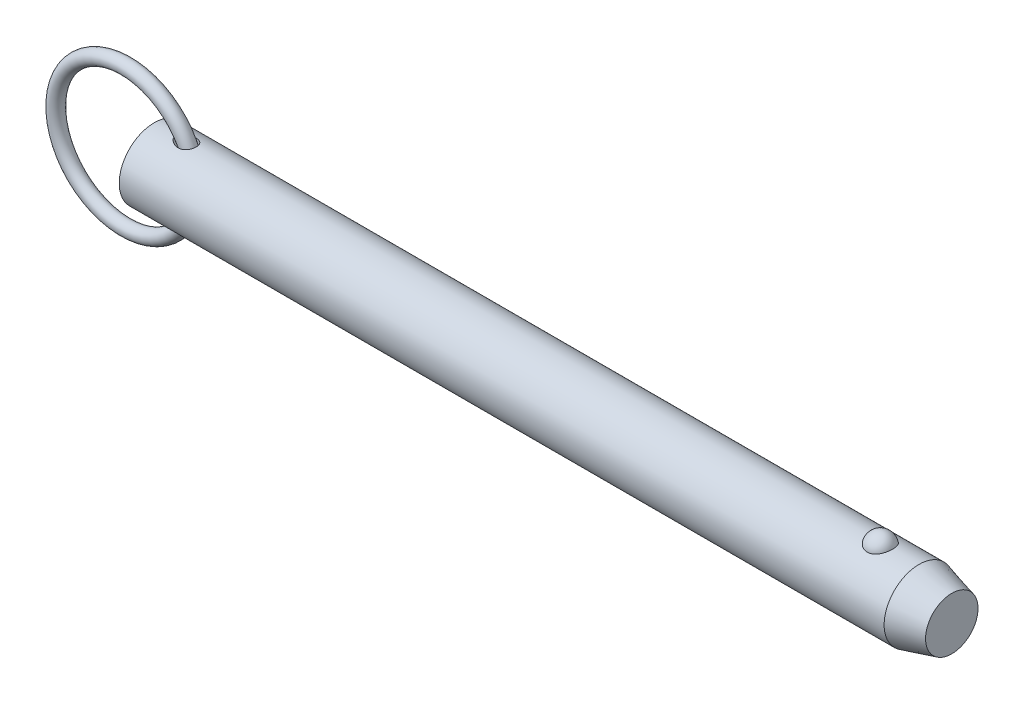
ISO-10303-21;
HEADER;
FILE_DESCRIPTION(('STEP AP214'),'2;1');
FILE_NAME('part.step','',(''),(''),'','','');
FILE_SCHEMA(('AUTOMOTIVE_DESIGN { 1 0 10303 214 1 1 1 1 }'));
ENDSEC;
DATA;
#1=APPLICATION_CONTEXT('core data for automotive mechanical design processes');
#2=APPLICATION_PROTOCOL_DEFINITION('international standard','automotive_design',2000,#1);
#3=PRODUCT_CONTEXT('',#1,'mechanical');
#4=PRODUCT('Part','Part','',(#3));
#5=PRODUCT_RELATED_PRODUCT_CATEGORY('part','',(#4));
#6=PRODUCT_DEFINITION_FORMATION('','',#4);
#7=PRODUCT_DEFINITION_CONTEXT('part definition',#1,'design');
#8=PRODUCT_DEFINITION('design','',#6,#7);
#9=PRODUCT_DEFINITION_SHAPE('','',#8);
#10=(LENGTH_UNIT() NAMED_UNIT(*) SI_UNIT(.MILLI.,.METRE.));
#11=(NAMED_UNIT(*) PLANE_ANGLE_UNIT() SI_UNIT($,.RADIAN.));
#12=(NAMED_UNIT(*) SI_UNIT($,.STERADIAN.) SOLID_ANGLE_UNIT());
#13=UNCERTAINTY_MEASURE_WITH_UNIT(LENGTH_MEASURE(1.E-05),#10,'distance_accuracy_value','');
#14=(GEOMETRIC_REPRESENTATION_CONTEXT(3) GLOBAL_UNCERTAINTY_ASSIGNED_CONTEXT((#13)) GLOBAL_UNIT_ASSIGNED_CONTEXT((#10,
#11,#12)) REPRESENTATION_CONTEXT('',''));
#15=CARTESIAN_POINT('',(0.,0.,0.));
#16=DIRECTION('',(0.,0.,1.));
#17=DIRECTION('',(1.,0.,0.));
#18=AXIS2_PLACEMENT_3D('',#15,#16,#17);
#19=CARTESIAN_POINT('',(-6.46799987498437,0.,0.));
#20=DIRECTION('',(0.,0.,1.));
#21=DIRECTION('',(1.,0.,0.));
#22=AXIS2_PLACEMENT_3D('',#19,#20,#21);
#23=TOROIDAL_SURFACE('',#22,15.875,1.588);
#24=CARTESIAN_POINT('',(10.9950001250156,0.,0.));
#25=VERTEX_POINT('',#24);
#26=VERTEX_LOOP('',#25);
#27=FACE_BOUND('',#26,.T.);
#28=ADVANCED_FACE('P0_F12',(#27),#23,.T.);
#29=CLOSED_SHELL('',(#28));
#30=MANIFOLD_SOLID_BREP('P0_B1',#29);
#31=CARTESIAN_POINT('',(0.,0.,0.));
#32=DIRECTION('',(1.,0.,0.));
#33=DIRECTION('',(0.,0.,-1.));
#34=AXIS2_PLACEMENT_3D('',#31,#32,#33);
#35=CYLINDRICAL_SURFACE('',#34,7.94);
#36=CARTESIAN_POINT('',(4.99454278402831,7.92831028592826,-0.430692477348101));
#37=CARTESIAN_POINT('',(5.02621962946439,7.92271974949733,-0.533554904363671));
#38=CARTESIAN_POINT('',(5.06869972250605,7.91528872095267,-0.633052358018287));
#39=CARTESIAN_POINT('',(5.17094751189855,7.89785690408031,-0.822566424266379));
#40=CARTESIAN_POINT('',(5.23077290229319,7.88784755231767,-0.912550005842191));
#41=CARTESIAN_POINT('',(5.37866013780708,7.8639674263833,-1.10117829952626));
#42=CARTESIAN_POINT('',(5.47004908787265,7.84973599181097,-1.19714712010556));
#43=CARTESIAN_POINT('',(5.66695490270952,7.82090787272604,-1.37293476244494));
#44=CARTESIAN_POINT('',(5.77247743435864,7.80631104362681,-1.45274707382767));
#45=CARTESIAN_POINT('',(5.99604254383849,7.77793596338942,-1.59776875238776));
#46=CARTESIAN_POINT('',(6.11428384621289,7.76417836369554,-1.66267404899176));
#47=CARTESIAN_POINT('',(6.35882685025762,7.73912410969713,-1.77564129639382));
#48=CARTESIAN_POINT('',(6.48513256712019,7.72782869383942,-1.82369477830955));
#49=CARTESIAN_POINT('',(6.76898453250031,7.70705630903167,-1.90977520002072));
#50=CARTESIAN_POINT('',(6.92778004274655,7.69837706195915,-1.94395681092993));
#51=CARTESIAN_POINT('',(7.24915504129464,7.6881294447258,-1.98412381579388));
#52=CARTESIAN_POINT('',(7.41173039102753,7.68655363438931,-1.99013871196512));
#53=CARTESIAN_POINT('',(7.697714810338,7.69094561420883,-1.97306069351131));
#54=CARTESIAN_POINT('',(7.82153338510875,7.69526202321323,-1.95634328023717));
#55=CARTESIAN_POINT('',(8.06460511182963,7.70859273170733,-1.90314615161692));
#56=CARTESIAN_POINT('',(8.18386164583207,7.7176034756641,-1.86668139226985));
#57=CARTESIAN_POINT('',(8.41450663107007,7.73959050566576,-1.77331230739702));
#58=CARTESIAN_POINT('',(8.52585042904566,7.75258738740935,-1.71630154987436));
#59=CARTESIAN_POINT('',(8.73575290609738,7.7809705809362,-1.58263416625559));
#60=CARTESIAN_POINT('',(8.83431445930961,7.7963563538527,-1.50598196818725));
#61=CARTESIAN_POINT('',(9.00639839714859,7.8259635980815,-1.34315626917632));
#62=CARTESIAN_POINT('',(9.08139772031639,7.84016008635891,-1.25853389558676));
#63=CARTESIAN_POINT('',(9.21545590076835,7.86710959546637,-1.07729126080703));
#64=CARTESIAN_POINT('',(9.27451869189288,7.87986297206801,-0.980673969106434));
#65=CARTESIAN_POINT('',(9.37315031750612,7.90198817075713,-0.782161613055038));
#66=CARTESIAN_POINT('',(9.41336512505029,7.91146854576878,-0.68059867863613));
#67=CARTESIAN_POINT('',(9.47650914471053,7.92664976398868,-0.471967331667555));
#68=CARTESIAN_POINT('',(9.49943917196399,7.93235078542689,-0.364899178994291));
#69=CARTESIAN_POINT('',(9.5274466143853,7.93934369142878,-0.14863226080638));
#70=CARTESIAN_POINT('',(9.53257574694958,7.9406483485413,-0.0394405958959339));
#71=CARTESIAN_POINT('',(9.52501411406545,7.93874464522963,0.178286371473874));
#72=CARTESIAN_POINT('',(9.51232314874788,7.93553623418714,0.286821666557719));
#73=CARTESIAN_POINT('',(9.46937875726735,7.92494527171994,0.500278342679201));
#74=CARTESIAN_POINT('',(9.43910562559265,7.9175580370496,0.605195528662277));
#75=CARTESIAN_POINT('',(9.36168926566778,7.8994090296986,0.808294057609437));
#76=CARTESIAN_POINT('',(9.3145467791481,7.88864740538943,0.906475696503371));
#77=CARTESIAN_POINT('',(9.20464679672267,7.86494645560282,1.09319438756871));
#78=CARTESIAN_POINT('',(9.14191093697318,7.85201015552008,1.18174456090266));
#79=CARTESIAN_POINT('',(9.00249124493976,7.82536913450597,1.34692675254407));
#80=CARTESIAN_POINT('',(8.92580850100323,7.81166447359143,1.42355969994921));
#81=CARTESIAN_POINT('',(8.76033130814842,7.78490157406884,1.56333296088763));
#82=CARTESIAN_POINT('',(8.67148512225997,7.77184644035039,1.62641250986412));
#83=CARTESIAN_POINT('',(8.48457694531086,7.74778101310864,1.73744892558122));
#84=CARTESIAN_POINT('',(8.38651410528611,7.73677090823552,1.78540439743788));
#85=CARTESIAN_POINT('',(8.18013312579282,7.71742695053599,1.86728938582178));
#86=CARTESIAN_POINT('',(8.07156725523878,7.7092102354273,1.90061897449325));
#87=CARTESIAN_POINT('',(7.85050876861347,7.6966502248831,1.95085652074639));
#88=CARTESIAN_POINT('',(7.73801453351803,7.69230854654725,1.967757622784));
#89=CARTESIAN_POINT('',(7.50002163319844,7.6873799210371,1.98693391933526));
#90=CARTESIAN_POINT('',(7.37438052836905,7.68722739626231,1.98751701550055));
#91=CARTESIAN_POINT('',(7.12435864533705,7.69142268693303,1.97121025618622));
#92=CARTESIAN_POINT('',(6.99997834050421,7.6957721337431,1.9543140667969));
#93=CARTESIAN_POINT('',(6.73521978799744,7.70925573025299,1.90049277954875));
#94=CARTESIAN_POINT('',(6.59543541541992,7.71903968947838,1.86081454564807));
#95=CARTESIAN_POINT('',(6.32319848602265,7.74233460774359,1.76138158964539));
#96=CARTESIAN_POINT('',(6.19076082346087,7.75585282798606,1.7015877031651));
#97=CARTESIAN_POINT('',(5.99269110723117,7.7785835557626,1.59336057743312));
#98=CARTESIAN_POINT('',(5.92332049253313,7.78707101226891,1.55151799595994));
#99=CARTESIAN_POINT('',(5.78862576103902,7.80440479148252,1.46183267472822));
#100=CARTESIAN_POINT('',(5.72330291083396,7.81325122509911,1.41398807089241));
#101=CARTESIAN_POINT('',(5.53492618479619,7.83980388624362,1.26162857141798));
#102=CARTESIAN_POINT('',(5.41884115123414,7.85759887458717,1.14795556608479));
#103=CARTESIAN_POINT('',(5.25731156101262,7.88350844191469,0.948390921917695));
#104=CARTESIAN_POINT('',(5.20241173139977,7.89260196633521,0.87019982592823));
#105=CARTESIAN_POINT('',(5.10541071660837,7.90897737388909,0.70602680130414));
#106=CARTESIAN_POINT('',(5.06329682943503,7.91626105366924,0.620052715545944));
#107=CARTESIAN_POINT('',(4.99458837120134,7.92827352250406,0.440665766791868));
#108=CARTESIAN_POINT('',(4.96816655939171,7.93297382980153,0.347182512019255));
#109=CARTESIAN_POINT('',(4.94275291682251,7.93751024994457,0.204498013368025));
#110=CARTESIAN_POINT('',(4.93665149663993,7.9386033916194,0.156529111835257));
#111=CARTESIAN_POINT('',(4.92932198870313,7.93991739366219,0.0602142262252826));
#112=CARTESIAN_POINT('',(4.92809242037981,7.94013851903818,0.011868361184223));
#113=CARTESIAN_POINT('',(4.93104052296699,7.93960920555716,-0.103241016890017));
#114=CARTESIAN_POINT('',(4.93747289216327,7.93845361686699,-0.169956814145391));
#115=CARTESIAN_POINT('',(4.95939910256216,7.93453812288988,-0.301777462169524));
#116=CARTESIAN_POINT('',(4.97489225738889,7.9317783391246,-0.36688243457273));
#117=CARTESIAN_POINT('',(4.99454278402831,7.92831028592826,-0.430692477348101));
#118=B_SPLINE_CURVE_WITH_KNOTS('',3,(#36,#37,#38,#39,#40,#41,#42,#43,#44,#45,#46,#47,#48,#49,
#50,#51,#52,#53,#54,#55,#56,#57,#58,#59,#60,#61,#62,#63,#64,#65,#66,#67,#68,#69,#70,#71,#72,#73,
#74,#75,#76,#77,#78,#79,#80,#81,#82,#83,#84,#85,#86,#87,#88,#89,#90,#91,#92,#93,#94,#95,#96,#97,
#98,#99,#100,#101,#102,#103,#104,#105,#106,#107,#108,#109,#110,#111,#112,#113,#114,#115,#116,
#117),.UNSPECIFIED.,.T.,.F.,(4,2,2,2,2,2,2,2,2,2,2,2,2,2,2,2,2,2,2,2,2,2,2,2,2,2,2,2,2,2,2,2,2,
2,2,2,2,2,2,2,4),(0.,0.323000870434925,0.647088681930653,1.04479679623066,1.4426648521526,
1.84804279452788,2.25362416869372,2.73917777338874,3.2242226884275,3.59772765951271,
3.97095014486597,4.34613445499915,4.72123425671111,5.06140749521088,5.40149668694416,
5.72887751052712,6.05624289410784,6.38265637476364,6.70907351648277,7.03585720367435,
7.36262652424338,7.68894495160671,8.01523792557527,8.34296459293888,8.67072147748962,
9.01089033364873,9.35120108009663,9.72668268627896,10.1023004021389,10.5375309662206,
10.9736138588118,11.2176803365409,11.461822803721,11.9480055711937,12.2349837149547,
12.5216758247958,12.8114683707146,12.9563497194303,13.1011870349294,13.3015737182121,
13.5019452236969),.UNSPECIFIED.);
#119=CARTESIAN_POINT('',(4.99454278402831,7.92831028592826,-0.430692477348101));
#120=VERTEX_POINT('',#119);
#121=EDGE_CURVE('P1_E40',#120,#120,#118,.T.);
#122=ORIENTED_EDGE('',*,*,#121,.T.);
#123=EDGE_LOOP('',(#122));
#124=FACE_BOUND('',#123,.T.);
#125=CARTESIAN_POINT('',(173.571879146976,0.,0.));
#126=DIRECTION('',(1.,0.,0.));
#127=DIRECTION('',(0.,0.,-1.));
#128=AXIS2_PLACEMENT_3D('',#125,#126,#127);
#129=CIRCLE('',#128,7.94);
#130=CARTESIAN_POINT('',(173.571879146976,0.,-7.94));
#131=VERTEX_POINT('',#130);
#132=EDGE_CURVE('P1_E25',#131,#131,#129,.T.);
#133=ORIENTED_EDGE('',*,*,#132,.F.);
#134=EDGE_LOOP('',(#133));
#135=FACE_BOUND('',#134,.T.);
#136=CARTESIAN_POINT('',(0.,0.,0.));
#137=DIRECTION('',(1.,0.,0.));
#138=DIRECTION('',(0.,0.,-1.));
#139=AXIS2_PLACEMENT_3D('',#136,#137,#138);
#140=CIRCLE('',#139,7.94);
#141=CARTESIAN_POINT('',(0.,0.,-7.94));
#142=VERTEX_POINT('',#141);
#143=EDGE_CURVE('P1_E9',#142,#142,#140,.T.);
#144=ORIENTED_EDGE('',*,*,#143,.T.);
#145=EDGE_LOOP('',(#144));
#146=FACE_BOUND('',#145,.T.);
#147=CARTESIAN_POINT('',(164.764907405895,7.37767842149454,2.93486986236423));
#148=CARTESIAN_POINT('',(164.612749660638,7.3776732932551,2.93487505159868));
#149=CARTESIAN_POINT('',(164.460632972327,7.38258419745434,2.92262454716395));
#150=CARTESIAN_POINT('',(164.160928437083,7.40163229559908,2.87404196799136));
#151=CARTESIAN_POINT('',(164.013339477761,7.41576720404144,2.83771585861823));
#152=CARTESIAN_POINT('',(163.727018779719,7.4516157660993,2.74218769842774));
#153=CARTESIAN_POINT('',(163.588274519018,7.47331841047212,2.68301886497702));
#154=CARTESIAN_POINT('',(163.322882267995,7.52194082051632,2.54350967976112));
#155=CARTESIAN_POINT('',(163.196236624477,7.54886159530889,2.46316523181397));
#156=CARTESIAN_POINT('',(162.954534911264,7.60594671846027,2.28090375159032));
#157=CARTESIAN_POINT('',(162.839906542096,7.63618114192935,2.1784421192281));
#158=CARTESIAN_POINT('',(162.628878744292,7.69614046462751,1.95608495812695));
#159=CARTESIAN_POINT('',(162.532482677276,7.72586526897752,1.83618622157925));
#160=CARTESIAN_POINT('',(162.355938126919,7.78314821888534,1.57628086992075));
#161=CARTESIAN_POINT('',(162.276707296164,7.81055035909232,1.43561546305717));
#162=CARTESIAN_POINT('',(162.141797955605,7.85879631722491,1.142363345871));
#163=CARTESIAN_POINT('',(162.086121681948,7.87963951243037,0.989775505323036));
#164=CARTESIAN_POINT('',(161.99881215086,7.91289645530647,0.674619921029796));
#165=CARTESIAN_POINT('',(161.96753090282,7.92518652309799,0.511941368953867));
#166=CARTESIAN_POINT('',(161.930975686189,7.93958930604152,0.183247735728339));
#167=CARTESIAN_POINT('',(161.925701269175,7.94170219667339,0.0172327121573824));
#168=CARTESIAN_POINT('',(161.941231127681,7.93554931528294,-0.312672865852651));
#169=CARTESIAN_POINT('',(161.961925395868,7.92732732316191,-0.476569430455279));
#170=CARTESIAN_POINT('',(162.02878655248,7.90141534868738,-0.798305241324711));
#171=CARTESIAN_POINT('',(162.074953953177,7.88372517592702,-0.956144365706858));
#172=CARTESIAN_POINT('',(162.191898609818,7.84066230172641,-1.26152073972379));
#173=CARTESIAN_POINT('',(162.262704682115,7.81528060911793,-1.40904568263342));
#174=CARTESIAN_POINT('',(162.427478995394,7.75948672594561,-1.68950598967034));
#175=CARTESIAN_POINT('',(162.521448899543,7.72907417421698,-1.82244030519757));
#176=CARTESIAN_POINT('',(162.730839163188,7.66640424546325,-2.07032792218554));
#177=CARTESIAN_POINT('',(162.846315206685,7.63414223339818,-2.18523308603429));
#178=CARTESIAN_POINT('',(163.0959006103,7.57149681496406,-2.39329737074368));
#179=CARTESIAN_POINT('',(163.230008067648,7.54111321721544,-2.48645870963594));
#180=CARTESIAN_POINT('',(163.510111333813,7.48650742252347,-2.64628132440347));
#181=CARTESIAN_POINT('',(163.655760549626,7.46215900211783,-2.71350554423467));
#182=CARTESIAN_POINT('',(163.957425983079,7.42171253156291,-2.82226614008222));
#183=CARTESIAN_POINT('',(164.113438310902,7.40561140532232,-2.86381209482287));
#184=CARTESIAN_POINT('',(164.422970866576,7.3842679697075,-2.9183907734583));
#185=CARTESIAN_POINT('',(164.576222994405,7.37852109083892,-2.93275024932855));
#186=CARTESIAN_POINT('',(164.883070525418,7.37700973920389,-2.93655208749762));
#187=CARTESIAN_POINT('',(165.036665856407,7.38124333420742,-2.92599927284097));
#188=CARTESIAN_POINT('',(165.334990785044,7.39890635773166,-2.88102897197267));
#189=CARTESIAN_POINT('',(165.479848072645,7.41205491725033,-2.84733999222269));
#190=CARTESIAN_POINT('',(165.76164329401,7.445801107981,-2.75788206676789));
#191=CARTESIAN_POINT('',(165.898580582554,7.46639934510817,-2.70211132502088));
#192=CARTESIAN_POINT('',(166.164061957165,7.51339098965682,-2.56858908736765));
#193=CARTESIAN_POINT('',(166.292354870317,7.53990200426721,-2.4903806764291));
#194=CARTESIAN_POINT('',(166.534244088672,7.59569503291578,-2.31462737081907));
#195=CARTESIAN_POINT('',(166.647837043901,7.6249776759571,-2.21707808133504));
#196=CARTESIAN_POINT('',(166.86322156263,7.68489473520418,-1.99982049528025));
#197=CARTESIAN_POINT('',(166.964148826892,7.71552419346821,-1.87925337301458));
#198=CARTESIAN_POINT('',(167.145186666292,7.77353016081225,-1.6226882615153));
#199=CARTESIAN_POINT('',(167.225293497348,7.80090608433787,-1.48668750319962));
#200=CARTESIAN_POINT('',(167.365361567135,7.85047992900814,-1.1981841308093));
#201=CARTESIAN_POINT('',(167.424587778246,7.87248183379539,-1.04529016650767));
#202=CARTESIAN_POINT('',(167.517982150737,7.90785114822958,-0.731080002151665));
#203=CARTESIAN_POINT('',(167.552149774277,7.92121837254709,-0.569763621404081));
#204=CARTESIAN_POINT('',(167.594795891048,7.93797834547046,-0.242812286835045));
#205=CARTESIAN_POINT('',(167.603204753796,7.94134405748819,-0.0771668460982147));
#206=CARTESIAN_POINT('',(167.593962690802,7.93767937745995,0.253276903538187));
#207=CARTESIAN_POINT('',(167.576312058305,7.93064910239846,0.418075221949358));
#208=CARTESIAN_POINT('',(167.515424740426,7.90695571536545,0.741525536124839));
#209=CARTESIAN_POINT('',(167.472281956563,7.8903279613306,0.900197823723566));
#210=CARTESIAN_POINT('',(167.36135358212,7.84916386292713,1.20759654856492));
#211=CARTESIAN_POINT('',(167.29356656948,7.82462706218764,1.35632241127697));
#212=CARTESIAN_POINT('',(167.134371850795,7.77006699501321,1.64032869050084));
#213=CARTESIAN_POINT('',(167.042861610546,7.74002008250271,1.7755471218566));
#214=CARTESIAN_POINT('',(166.838296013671,7.67774175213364,2.0280064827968));
#215=CARTESIAN_POINT('',(166.725241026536,7.64551037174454,2.14524772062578));
#216=CARTESIAN_POINT('',(166.480831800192,7.58265895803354,2.35778002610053));
#217=CARTESIAN_POINT('',(166.349583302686,7.5520309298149,2.45319004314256));
#218=CARTESIAN_POINT('',(166.071601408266,7.49579792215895,2.61999897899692));
#219=CARTESIAN_POINT('',(165.924867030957,7.47019326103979,2.69139637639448));
#220=CARTESIAN_POINT('',(165.612947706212,7.42622216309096,2.8105324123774));
#221=CARTESIAN_POINT('',(165.447220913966,7.40825002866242,2.85700910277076));
#222=CARTESIAN_POINT('',(165.109279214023,7.38398348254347,2.9191685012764));
#223=CARTESIAN_POINT('',(164.93706702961,7.3776842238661,2.93486399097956));
#224=CARTESIAN_POINT('',(164.764907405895,7.37767842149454,2.93486986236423));
#225=B_SPLINE_CURVE_WITH_KNOTS('',3,(#147,#148,#149,#150,#151,#152,#153,#154,#155,#156,#157,
#158,#159,#160,#161,#162,#163,#164,#165,#166,#167,#168,#169,#170,#171,#172,#173,#174,#175,#176,
#177,#178,#179,#180,#181,#182,#183,#184,#185,#186,#187,#188,#189,#190,#191,#192,#193,#194,#195,
#196,#197,#198,#199,#200,#201,#202,#203,#204,#205,#206,#207,#208,#209,#210,#211,#212,#213,#214,
#215,#216,#217,#218,#219,#220,#221,#222,#223,#224),.UNSPECIFIED.,.T.,.F.,(4,2,2,2,2,2,2,2,2,2,2,
2,2,2,2,2,2,2,2,2,2,2,2,2,2,2,2,2,2,2,2,2,2,2,2,2,2,2,4),(0.,0.455841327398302,
0.911569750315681,1.36663794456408,1.82179423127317,2.2897898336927,2.75787163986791,
3.24685368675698,3.73588214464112,4.23184282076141,4.72779494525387,5.22165321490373,
5.71552141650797,6.20996917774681,6.7044524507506,7.20023431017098,7.69596557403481,
8.18023418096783,8.66432203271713,9.12410697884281,9.58380291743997,10.0296503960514,
10.4755341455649,10.9312349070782,11.3870393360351,11.8654416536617,12.3439299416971,
12.8378875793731,13.3318558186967,13.8271581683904,14.3224549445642,14.8159385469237,
15.3094506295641,15.8051323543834,16.3008055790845,16.7937101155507,17.2866458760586,
17.8026240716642,18.3183879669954),.UNSPECIFIED.);
#226=CARTESIAN_POINT('',(164.764907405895,7.37767842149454,2.93486986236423));
#227=VERTEX_POINT('',#226);
#228=EDGE_CURVE('P1_E34',#227,#227,#225,.T.);
#229=ORIENTED_EDGE('',*,*,#228,.T.);
#230=EDGE_LOOP('',(#229));
#231=FACE_BOUND('',#230,.T.);
#232=CARTESIAN_POINT('',(4.99454278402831,-7.92831028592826,-0.430692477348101));
#233=CARTESIAN_POINT('',(4.97033227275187,-7.93258231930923,-0.352006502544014));
#234=CARTESIAN_POINT('',(4.95238785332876,-7.93578782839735,-0.271213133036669));
#235=CARTESIAN_POINT('',(4.93055628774,-7.93969351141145,-0.107590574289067));
#236=CARTESIAN_POINT('',(4.92668686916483,-7.9403905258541,-0.0247589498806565));
#237=CARTESIAN_POINT('',(4.9333808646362,-7.93918950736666,0.140249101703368));
#238=CARTESIAN_POINT('',(4.94393526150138,-7.93729309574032,0.222425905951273));
#239=CARTESIAN_POINT('',(4.97854187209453,-7.93113325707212,0.383746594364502));
#240=CARTESIAN_POINT('',(5.00259804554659,-7.92686913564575,0.462889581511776));
#241=CARTESIAN_POINT('',(5.06904511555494,-7.91526143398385,0.633278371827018));
#242=CARTESIAN_POINT('',(5.11430124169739,-7.90744739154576,0.723368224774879));
#243=CARTESIAN_POINT('',(5.21873327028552,-7.88988375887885,0.894880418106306));
#244=CARTESIAN_POINT('',(5.27793532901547,-7.88013053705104,0.976286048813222));
#245=CARTESIAN_POINT('',(5.42949971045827,-7.85602233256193,1.15646341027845));
#246=CARTESIAN_POINT('',(5.52624420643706,-7.84124381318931,1.25147911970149));
#247=CARTESIAN_POINT('',(5.73364751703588,-7.81163164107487,1.42469165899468));
#248=CARTESIAN_POINT('',(5.84432059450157,-7.79679794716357,1.50287102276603));
#249=CARTESIAN_POINT('',(6.07871104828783,-7.76824211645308,1.64418004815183));
#250=CARTESIAN_POINT('',(6.20267992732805,-7.75455572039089,1.70689813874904));
#251=CARTESIAN_POINT('',(6.45850163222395,-7.73013259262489,1.81429879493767));
#252=CARTESIAN_POINT('',(6.59035778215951,-7.71939711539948,1.85897369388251));
#253=CARTESIAN_POINT('',(6.88209177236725,-7.70072462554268,1.93500734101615));
#254=CARTESIAN_POINT('',(7.04295460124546,-7.69356120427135,1.96286607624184));
#255=CARTESIAN_POINT('',(7.36724421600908,-7.68676336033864,1.98935053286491));
#256=CARTESIAN_POINT('',(7.53066723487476,-7.68711875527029,1.98801578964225));
#257=CARTESIAN_POINT('',(7.81370255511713,-7.69496475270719,1.95735673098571));
#258=CARTESIAN_POINT('',(7.93413357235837,-7.70066491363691,1.93505220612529));
#259=CARTESIAN_POINT('',(8.16950597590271,-7.71642704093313,1.87121573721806));
#260=CARTESIAN_POINT('',(8.28445128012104,-7.72648584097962,1.82969774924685));
#261=CARTESIAN_POINT('',(8.50557964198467,-7.75006886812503,1.72707806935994));
#262=CARTESIAN_POINT('',(8.61171927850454,-7.76360905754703,1.66588583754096));
#263=CARTESIAN_POINT('',(8.810712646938,-7.79249659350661,1.52503518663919));
#264=CARTESIAN_POINT('',(8.90356827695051,-7.80784368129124,1.44537941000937));
#265=CARTESIAN_POINT('',(9.06550151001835,-7.83702302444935,1.27723027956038));
#266=CARTESIAN_POINT('',(9.1359139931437,-7.85087516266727,1.19002179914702));
#267=CARTESIAN_POINT('',(9.26060432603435,-7.87675706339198,1.00451336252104));
#268=CARTESIAN_POINT('',(9.31488561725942,-7.88878721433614,0.906215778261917));
#269=CARTESIAN_POINT('',(9.40446618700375,-7.90930761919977,0.70456335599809));
#270=CARTESIAN_POINT('',(9.44028687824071,-7.91789338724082,0.601449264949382));
#271=CARTESIAN_POINT('',(9.49451523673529,-7.93109531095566,0.390496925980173));
#272=CARTESIAN_POINT('',(9.51292345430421,-7.93571159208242,0.282658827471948));
#273=CARTESIAN_POINT('',(9.53189686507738,-7.94047189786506,0.0654759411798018));
#274=CARTESIAN_POINT('',(9.53248611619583,-7.94062195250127,-0.0438666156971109));
#275=CARTESIAN_POINT('',(9.51587068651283,-7.93644929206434,-0.26110665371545));
#276=CARTESIAN_POINT('',(9.49866585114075,-7.93212653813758,-0.369004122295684));
#277=CARTESIAN_POINT('',(9.44682594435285,-7.91946859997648,-0.58038072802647));
#278=CARTESIAN_POINT('',(9.412176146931,-7.91113002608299,-0.683856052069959));
#279=CARTESIAN_POINT('',(9.32626198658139,-7.89134774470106,-0.883337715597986));
#280=CARTESIAN_POINT('',(9.27499851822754,-7.87990420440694,-0.979344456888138));
#281=CARTESIAN_POINT('',(9.15725058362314,-7.8551872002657,-1.1610523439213));
#282=CARTESIAN_POINT('',(9.09078836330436,-7.84191642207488,-1.24676827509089));
#283=CARTESIAN_POINT('',(8.94443523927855,-7.81498501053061,-1.40574704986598));
#284=CARTESIAN_POINT('',(8.86454527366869,-7.80132440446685,-1.47901076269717));
#285=CARTESIAN_POINT('',(8.69307774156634,-7.77497848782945,-1.61181253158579));
#286=CARTESIAN_POINT('',(8.60142539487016,-7.76230033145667,-1.67125525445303));
#287=CARTESIAN_POINT('',(8.40957687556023,-7.73928987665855,-1.77477159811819));
#288=CARTESIAN_POINT('',(8.30937953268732,-7.72895790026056,-1.81884310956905));
#289=CARTESIAN_POINT('',(8.0986350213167,-7.71113842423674,-1.89300673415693));
#290=CARTESIAN_POINT('',(7.98782526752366,-7.70379913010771,-1.92238394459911));
#291=CARTESIAN_POINT('',(7.76294389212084,-7.69313871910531,-1.96460780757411));
#292=CARTESIAN_POINT('',(7.64887102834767,-7.68981915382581,-1.9774480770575));
#293=CARTESIAN_POINT('',(7.40716929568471,-7.68706358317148,-1.98813881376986));
#294=CARTESIAN_POINT('',(7.27945620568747,-7.68810537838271,-1.98414471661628));
#295=CARTESIAN_POINT('',(7.02593945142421,-7.6946815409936,-1.95847707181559));
#296=CARTESIAN_POINT('',(6.90013720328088,-7.7002190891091,-1.93679100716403));
#297=CARTESIAN_POINT('',(6.63265145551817,-7.71617635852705,-1.87230070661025));
#298=CARTESIAN_POINT('',(6.49169161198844,-7.72724102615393,-1.82664736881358));
#299=CARTESIAN_POINT('',(6.21840602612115,-7.75282261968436,-1.71482542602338));
#300=CARTESIAN_POINT('',(6.08608498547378,-7.76734140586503,-1.64864576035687));
#301=CARTESIAN_POINT('',(5.84453114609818,-7.7967744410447,-1.50297952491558));
#302=CARTESIAN_POINT('',(5.73429128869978,-7.81154606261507,-1.4251373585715));
#303=CARTESIAN_POINT('',(5.52761180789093,-7.84104229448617,-1.25271210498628));
#304=CARTESIAN_POINT('',(5.43116004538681,-7.85576693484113,-1.15814390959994));
#305=CARTESIAN_POINT('',(5.27970568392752,-7.87984260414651,-0.978603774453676));
#306=CARTESIAN_POINT('',(5.22040249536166,-7.88960721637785,-0.897319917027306));
#307=CARTESIAN_POINT('',(5.11583115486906,-7.90718602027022,-0.726171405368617));
#308=CARTESIAN_POINT('',(5.07050564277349,-7.9150081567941,-0.636343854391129));
#309=CARTESIAN_POINT('',(5.01937588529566,-7.92393751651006,-0.506165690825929));
#310=CARTESIAN_POINT('',(5.00622932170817,-7.926248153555,-0.468674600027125));
#311=CARTESIAN_POINT('',(4.99454278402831,-7.92831028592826,-0.430692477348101));
#312=B_SPLINE_CURVE_WITH_KNOTS('',3,(#232,#233,#234,#235,#236,#237,#238,#239,#240,#241,#242,
#243,#244,#245,#246,#247,#248,#249,#250,#251,#252,#253,#254,#255,#256,#257,#258,#259,#260,#261,
#262,#263,#264,#265,#266,#267,#268,#269,#270,#271,#272,#273,#274,#275,#276,#277,#278,#279,#280,
#281,#282,#283,#284,#285,#286,#287,#288,#289,#290,#291,#292,#293,#294,#295,#296,#297,#298,#299,
#300,#301,#302,#303,#304,#305,#306,#307,#308,#309,#310,#311),.UNSPECIFIED.,.T.,.F.,(4,2,2,2,2,2,
2,2,2,2,2,2,2,2,2,2,2,2,2,2,2,2,2,2,2,2,2,2,2,2,2,2,2,2,2,2,2,2,2,4),(0.,0.247186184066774,
0.494683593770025,0.742026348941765,0.989441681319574,1.29115800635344,1.59344478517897,
2.00047108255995,2.40791761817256,2.82525860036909,3.2427767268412,3.7304673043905,
4.21749746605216,4.58380730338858,4.94985148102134,5.31760488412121,5.68530568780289,
6.02244390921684,6.35951015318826,6.68644714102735,7.01337379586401,7.33985903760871,
7.66634711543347,7.9931112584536,8.31985780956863,8.64612913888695,8.97237768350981,
9.30081392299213,9.62929521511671,9.9724956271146,10.3158284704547,10.6977037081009,
11.0798493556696,11.523823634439,11.9680375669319,12.3738595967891,12.7793221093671,
13.0815405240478,13.3825016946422,13.5018197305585),.UNSPECIFIED.);
#313=CARTESIAN_POINT('',(4.99454278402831,-7.92831028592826,-0.430692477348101));
#314=VERTEX_POINT('',#313);
#315=EDGE_CURVE('P1_E17',#314,#314,#312,.T.);
#316=ORIENTED_EDGE('',*,*,#315,.T.);
#317=EDGE_LOOP('',(#316));
#318=FACE_BOUND('',#317,.T.);
#319=ADVANCED_FACE('P1_F13',(#124,#135,#146,#231,#318),#35,.T.);
#320=CARTESIAN_POINT('',(0.,0.,0.));
#321=DIRECTION('',(-1.,0.,0.));
#322=DIRECTION('',(0.,0.,1.));
#323=AXIS2_PLACEMENT_3D('',#320,#321,#322);
#324=PLANE('',#323);
#325=ORIENTED_EDGE('',*,*,#143,.F.);
#326=EDGE_LOOP('',(#325));
#327=FACE_BOUND('',#326,.T.);
#328=ADVANCED_FACE('P1_F15',(#327),#324,.T.);
#329=CARTESIAN_POINT('',(180.98,0.,0.));
#330=DIRECTION('',(-1.,0.,0.));
#331=DIRECTION('',(0.,0.,1.));
#332=AXIS2_PLACEMENT_3D('',#329,#330,#331);
#333=CONICAL_SURFACE('',#332,5.95500000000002,0.26179938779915);
#334=ORIENTED_EDGE('',*,*,#132,.T.);
#335=EDGE_LOOP('',(#334));
#336=FACE_BOUND('',#335,.T.);
#337=CARTESIAN_POINT('',(180.98,0.,0.));
#338=DIRECTION('',(1.,0.,0.));
#339=DIRECTION('',(0.,0.,-1.));
#340=AXIS2_PLACEMENT_3D('',#337,#338,#339);
#341=CIRCLE('',#340,5.95500000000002);
#342=CARTESIAN_POINT('',(180.98,0.,-5.95500000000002));
#343=VERTEX_POINT('',#342);
#344=EDGE_CURVE('P1_E30',#343,#343,#341,.T.);
#345=ORIENTED_EDGE('',*,*,#344,.F.);
#346=EDGE_LOOP('',(#345));
#347=FACE_BOUND('',#346,.T.);
#348=ADVANCED_FACE('P1_F55',(#336,#347),#333,.T.);
#349=CARTESIAN_POINT('',(180.98,5.95500000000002,0.));
#350=DIRECTION('',(1.,0.,0.));
#351=DIRECTION('',(0.,0.,-1.));
#352=AXIS2_PLACEMENT_3D('',#349,#350,#351);
#353=PLANE('',#352);
#354=ORIENTED_EDGE('',*,*,#344,.T.);
#355=EDGE_LOOP('',(#354));
#356=FACE_BOUND('',#355,.T.);
#357=ADVANCED_FACE('P1_F51',(#356),#353,.T.);
#358=CARTESIAN_POINT('',(164.764907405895,7.146,0.));
#359=DIRECTION('',(-1.,0.,0.));
#360=DIRECTION('',(0.,-1.,0.));
#361=AXIS2_PLACEMENT_3D('',#358,#359,#360);
#362=SPHERICAL_SURFACE('',#361,2.944);
#363=ORIENTED_EDGE('',*,*,#228,.F.);
#364=EDGE_LOOP('',(#363));
#365=FACE_BOUND('',#364,.T.);
#366=ADVANCED_FACE('P1_F46',(#365),#362,.T.);
#367=CARTESIAN_POINT('',(-6.46799987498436,0.,0.));
#368=DIRECTION('',(0.,0.,1.));
#369=DIRECTION('',(1.,0.,0.));
#370=AXIS2_PLACEMENT_3D('',#367,#368,#369);
#371=TOROIDAL_SURFACE('',#370,15.875,1.985);
#372=ORIENTED_EDGE('',*,*,#315,.F.);
#373=EDGE_LOOP('',(#372));
#374=FACE_BOUND('',#373,.T.);
#375=ORIENTED_EDGE('',*,*,#121,.F.);
#376=EDGE_LOOP('',(#375));
#377=FACE_BOUND('',#376,.T.);
#378=ADVANCED_FACE('P1_F50',(#374,#377),#371,.F.);
#379=CLOSED_SHELL('',(#319,#328,#348,#357,#366,#378));
#380=MANIFOLD_SOLID_BREP('P1_B1',#379);
#381=ADVANCED_BREP_SHAPE_REPRESENTATION('',(#18,#30,#380),#14);
#382=SHAPE_DEFINITION_REPRESENTATION(#9,#381);
ENDSEC;
END-ISO-10303-21;
